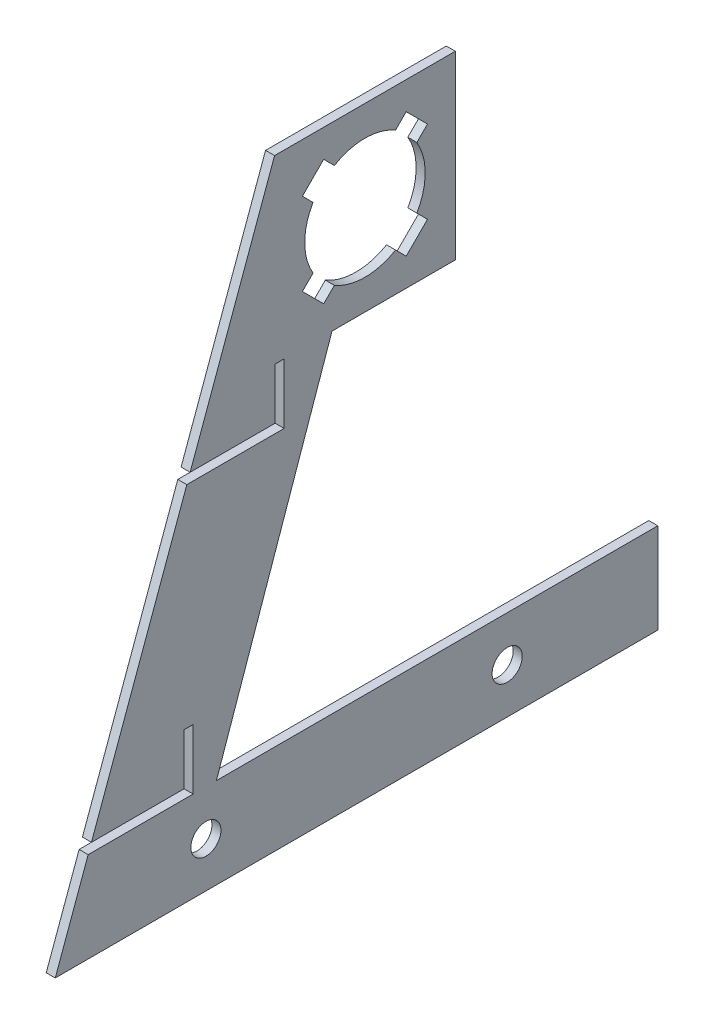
from build123d import *

# Parameters (mm, degrees)
SKETCH1_R           = 5
BOSS_EXTRUDE1_DEPTH = 3


with BuildPart() as part:
    # Sketch1 → Boss-Extrude1 (new body)
    with BuildSketch(Plane(origin=(0, 0, 0), x_dir=(0, 0, -1), z_dir=(1, 0, 0))):
        Polygon((-67.096727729, -58.276345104), (-28.710207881, 51.753952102), (12.222128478, 51.753952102), (12.222128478, 111.753952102), (-47.777871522, 111.753952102), (-75.814606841, 34.723654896), (-47.592405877, 34.723654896), (-47.592405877, 51.723654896), (-44.592405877, 51.723654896), (-44.592405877, 31.723654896), (-76.906517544, 31.723654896), (-108.571927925, -55.276345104), (-77.805609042, -55.276345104), (-77.805609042, -38.276345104), (-74.805609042, -38.276345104), (-74.805609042, -58.276345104), (-109.663838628, -58.276345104), (-120.571918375, -88.246047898), (-120.582945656, -88.276345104), (79.428081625, -88.276345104), (79.428081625, -58.276345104), align=None)
        with Locations((29.428081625, -73.276345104)):
            Circle(SKETCH1_R, mode=Mode.SUBTRACT)
        with Locations((-70.571918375, -73.276345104)):
            Circle(SKETCH1_R, mode=Mode.SUBTRACT)
        with BuildLine():
            Line((-27.935401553, 64.525354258), (-31.470935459, 60.989820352))
            Line((-31.470935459, 60.989820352), (-38.542003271, 68.060888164))
            Line((-38.542003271, 68.060888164), (-35.006469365, 71.59642207))
            ThreePointArc((-35.006469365, 71.59642207), (-37.777871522, 81.753952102), (-35.006469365, 91.911482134))
            Line((-35.006469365, 91.911482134), (-38.542003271, 95.447016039))
            Line((-38.542003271, 95.447016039), (-31.470935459, 102.518083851))
            Line((-31.470935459, 102.518083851), (-27.935401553, 98.982549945))
            ThreePointArc((-27.935401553, 98.982549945), (-17.777871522, 101.753952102), (-7.62034149, 98.982549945))
            Line((-7.62034149, 98.982549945), (-4.084807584, 102.518083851))
            Line((-4.084807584, 102.518083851), (2.986260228, 95.447016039))
            Line((2.986260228, 95.447016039), (-0.549273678, 91.911482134))
            ThreePointArc((-0.549273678, 91.911482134), (2.222128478, 81.753952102), (-0.549273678, 71.59642207))
            Line((-0.549273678, 71.59642207), (2.986260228, 68.060888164))
            Line((2.986260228, 68.060888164), (-4.084807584, 60.989820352))
            Line((-4.084807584, 60.989820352), (-7.62034149, 64.525354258))
            ThreePointArc((-7.62034149, 64.525354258), (-17.777871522, 61.753952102), (-27.935401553, 64.525354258))
        make_face(mode=Mode.SUBTRACT)
    extrude(amount=BOSS_EXTRUDE1_DEPTH)


solid = part.part
